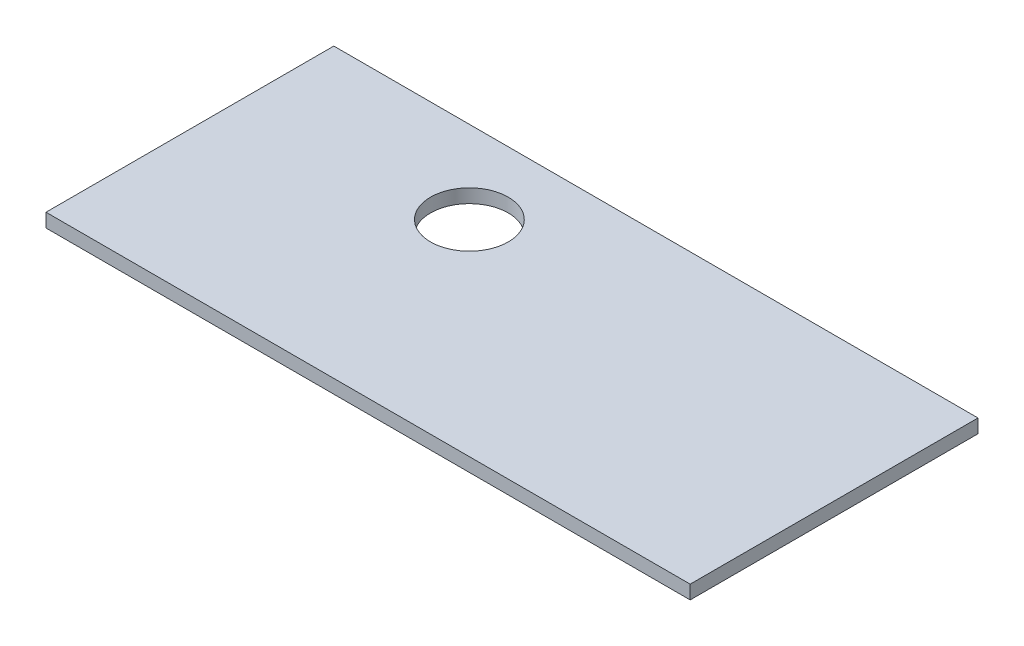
ISO-10303-21;
HEADER;
FILE_DESCRIPTION(('STEP AP214'),'2;1');
FILE_NAME('part.step','',(''),(''),'','','');
FILE_SCHEMA(('AUTOMOTIVE_DESIGN { 1 0 10303 214 1 1 1 1 }'));
ENDSEC;
DATA;
#1=APPLICATION_CONTEXT('core data for automotive mechanical design processes');
#2=APPLICATION_PROTOCOL_DEFINITION('international standard','automotive_design',2000,#1);
#3=PRODUCT_CONTEXT('',#1,'mechanical');
#4=PRODUCT('Part','Part','',(#3));
#5=PRODUCT_RELATED_PRODUCT_CATEGORY('part','',(#4));
#6=PRODUCT_DEFINITION_FORMATION('','',#4);
#7=PRODUCT_DEFINITION_CONTEXT('part definition',#1,'design');
#8=PRODUCT_DEFINITION('design','',#6,#7);
#9=PRODUCT_DEFINITION_SHAPE('','',#8);
#10=(LENGTH_UNIT() NAMED_UNIT(*) SI_UNIT(.MILLI.,.METRE.));
#11=(NAMED_UNIT(*) PLANE_ANGLE_UNIT() SI_UNIT($,.RADIAN.));
#12=(NAMED_UNIT(*) SI_UNIT($,.STERADIAN.) SOLID_ANGLE_UNIT());
#13=UNCERTAINTY_MEASURE_WITH_UNIT(LENGTH_MEASURE(1.E-05),#10,'distance_accuracy_value','');
#14=(GEOMETRIC_REPRESENTATION_CONTEXT(3) GLOBAL_UNCERTAINTY_ASSIGNED_CONTEXT((#13)) GLOBAL_UNIT_ASSIGNED_CONTEXT((#10,
#11,#12)) REPRESENTATION_CONTEXT('',''));
#15=CARTESIAN_POINT('',(0.,0.,0.));
#16=DIRECTION('',(0.,0.,1.));
#17=DIRECTION('',(1.,0.,0.));
#18=AXIS2_PLACEMENT_3D('',#15,#16,#17);
#19=CARTESIAN_POINT('',(70.5,3.,31.5));
#20=DIRECTION('',(-1.,0.,0.));
#21=DIRECTION('',(0.,0.,1.));
#22=AXIS2_PLACEMENT_3D('',#19,#20,#21);
#23=PLANE('',#22);
#24=DIRECTION('',(0.,0.,-1.));
#25=VECTOR('',#24,1.);
#26=CARTESIAN_POINT('',(70.5,0.,31.5));
#27=LINE('',#26,#25);
#28=CARTESIAN_POINT('',(70.5,0.,31.5));
#29=VERTEX_POINT('',#28);
#30=CARTESIAN_POINT('',(70.5,0.,-31.5));
#31=VERTEX_POINT('',#30);
#32=EDGE_CURVE('E97',#29,#31,#27,.T.);
#33=ORIENTED_EDGE('',*,*,#32,.T.);
#34=DIRECTION('',(0.,-1.,0.));
#35=VECTOR('',#34,1.);
#36=CARTESIAN_POINT('',(70.5,3.,-31.5));
#37=LINE('',#36,#35);
#38=CARTESIAN_POINT('',(70.5,3.,-31.5));
#39=VERTEX_POINT('',#38);
#40=EDGE_CURVE('E11',#39,#31,#37,.T.);
#41=ORIENTED_EDGE('',*,*,#40,.F.);
#42=DIRECTION('',(0.,0.,-1.));
#43=VECTOR('',#42,1.);
#44=CARTESIAN_POINT('',(70.5,3.,31.5));
#45=LINE('',#44,#43);
#46=CARTESIAN_POINT('',(70.5,3.,31.5));
#47=VERTEX_POINT('',#46);
#48=EDGE_CURVE('E85',#47,#39,#45,.T.);
#49=ORIENTED_EDGE('',*,*,#48,.F.);
#50=DIRECTION('',(0.,-1.,0.));
#51=VECTOR('',#50,1.);
#52=CARTESIAN_POINT('',(70.5,3.,31.5));
#53=LINE('',#52,#51);
#54=EDGE_CURVE('E93',#47,#29,#53,.T.);
#55=ORIENTED_EDGE('',*,*,#54,.T.);
#56=EDGE_LOOP('',(#33,#41,#49,#55));
#57=FACE_BOUND('',#56,.T.);
#58=ADVANCED_FACE('F34',(#57),#23,.F.);
#59=CARTESIAN_POINT('',(-70.5,3.,-31.5));
#60=DIRECTION('',(0.,0.,1.));
#61=DIRECTION('',(1.,0.,0.));
#62=AXIS2_PLACEMENT_3D('',#59,#60,#61);
#63=PLANE('',#62);
#64=DIRECTION('',(-1.,0.,0.));
#65=VECTOR('',#64,1.);
#66=CARTESIAN_POINT('',(-70.5,0.,-31.5));
#67=LINE('',#66,#65);
#68=CARTESIAN_POINT('',(-70.5,0.,-31.5));
#69=VERTEX_POINT('',#68);
#70=EDGE_CURVE('E89',#31,#69,#67,.T.);
#71=ORIENTED_EDGE('',*,*,#70,.T.);
#72=DIRECTION('',(0.,-1.,0.));
#73=VECTOR('',#72,1.);
#74=CARTESIAN_POINT('',(-70.5,3.,-31.5));
#75=LINE('',#74,#73);
#76=CARTESIAN_POINT('',(-70.5,3.,-31.5));
#77=VERTEX_POINT('',#76);
#78=EDGE_CURVE('E42',#77,#69,#75,.T.);
#79=ORIENTED_EDGE('',*,*,#78,.F.);
#80=DIRECTION('',(-1.,0.,0.));
#81=VECTOR('',#80,1.);
#82=CARTESIAN_POINT('',(-70.5,3.,-31.5));
#83=LINE('',#82,#81);
#84=EDGE_CURVE('E80',#39,#77,#83,.T.);
#85=ORIENTED_EDGE('',*,*,#84,.F.);
#86=ORIENTED_EDGE('',*,*,#40,.T.);
#87=EDGE_LOOP('',(#71,#79,#85,#86));
#88=FACE_BOUND('',#87,.T.);
#89=ADVANCED_FACE('F88',(#88),#63,.F.);
#90=CARTESIAN_POINT('',(-70.5,3.,31.5));
#91=DIRECTION('',(1.,0.,0.));
#92=DIRECTION('',(0.,0.,-1.));
#93=AXIS2_PLACEMENT_3D('',#90,#91,#92);
#94=PLANE('',#93);
#95=DIRECTION('',(0.,0.,1.));
#96=VECTOR('',#95,1.);
#97=CARTESIAN_POINT('',(-70.5,0.,31.5));
#98=LINE('',#97,#96);
#99=CARTESIAN_POINT('',(-70.5,0.,31.5));
#100=VERTEX_POINT('',#99);
#101=EDGE_CURVE('E67',#69,#100,#98,.T.);
#102=ORIENTED_EDGE('',*,*,#101,.T.);
#103=DIRECTION('',(0.,-1.,0.));
#104=VECTOR('',#103,1.);
#105=CARTESIAN_POINT('',(-70.5,3.,31.5));
#106=LINE('',#105,#104);
#107=CARTESIAN_POINT('',(-70.5,3.,31.5));
#108=VERTEX_POINT('',#107);
#109=EDGE_CURVE('E90',#108,#100,#106,.T.);
#110=ORIENTED_EDGE('',*,*,#109,.F.);
#111=DIRECTION('',(0.,0.,1.));
#112=VECTOR('',#111,1.);
#113=CARTESIAN_POINT('',(-70.5,3.,31.5));
#114=LINE('',#113,#112);
#115=EDGE_CURVE('E83',#77,#108,#114,.T.);
#116=ORIENTED_EDGE('',*,*,#115,.F.);
#117=ORIENTED_EDGE('',*,*,#78,.T.);
#118=EDGE_LOOP('',(#102,#110,#116,#117));
#119=FACE_BOUND('',#118,.T.);
#120=ADVANCED_FACE('F91',(#119),#94,.F.);
#121=CARTESIAN_POINT('',(-70.5,3.,31.5));
#122=DIRECTION('',(0.,0.,-1.));
#123=DIRECTION('',(-1.,0.,0.));
#124=AXIS2_PLACEMENT_3D('',#121,#122,#123);
#125=PLANE('',#124);
#126=DIRECTION('',(1.,0.,0.));
#127=VECTOR('',#126,1.);
#128=CARTESIAN_POINT('',(-70.5,0.,31.5));
#129=LINE('',#128,#127);
#130=EDGE_CURVE('E73',#100,#29,#129,.T.);
#131=ORIENTED_EDGE('',*,*,#130,.T.);
#132=ORIENTED_EDGE('',*,*,#54,.F.);
#133=DIRECTION('',(1.,0.,0.));
#134=VECTOR('',#133,1.);
#135=CARTESIAN_POINT('',(-70.5,3.,31.5));
#136=LINE('',#135,#134);
#137=EDGE_CURVE('E50',#108,#47,#136,.T.);
#138=ORIENTED_EDGE('',*,*,#137,.F.);
#139=ORIENTED_EDGE('',*,*,#109,.T.);
#140=EDGE_LOOP('',(#131,#132,#138,#139));
#141=FACE_BOUND('',#140,.T.);
#142=ADVANCED_FACE('F105',(#141),#125,.F.);
#143=CARTESIAN_POINT('',(0.,3.,0.));
#144=DIRECTION('',(0.,-1.,0.));
#145=DIRECTION('',(0.,0.,-1.));
#146=AXIS2_PLACEMENT_3D('',#143,#144,#145);
#147=PLANE('',#146);
#148=CARTESIAN_POINT('',(-22.7794225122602,3.,-13.4534041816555));
#149=DIRECTION('',(0.,1.,0.));
#150=DIRECTION('',(0.,0.,1.));
#151=AXIS2_PLACEMENT_3D('',#148,#149,#150);
#152=CIRCLE('',#151,8.5);
#153=CARTESIAN_POINT('',(-22.7794225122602,3.,-4.9534041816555));
#154=VERTEX_POINT('',#153);
#155=EDGE_CURVE('E100',#154,#154,#152,.T.);
#156=ORIENTED_EDGE('',*,*,#155,.F.);
#157=EDGE_LOOP('',(#156));
#158=FACE_BOUND('',#157,.T.);
#159=ORIENTED_EDGE('',*,*,#48,.T.);
#160=ORIENTED_EDGE('',*,*,#84,.T.);
#161=ORIENTED_EDGE('',*,*,#115,.T.);
#162=ORIENTED_EDGE('',*,*,#137,.T.);
#163=EDGE_LOOP('',(#159,#160,#161,#162));
#164=FACE_BOUND('',#163,.T.);
#165=ADVANCED_FACE('F81',(#158,#164),#147,.F.);
#166=CARTESIAN_POINT('',(0.,0.,0.));
#167=DIRECTION('',(0.,-1.,0.));
#168=DIRECTION('',(0.,0.,-1.));
#169=AXIS2_PLACEMENT_3D('',#166,#167,#168);
#170=PLANE('',#169);
#171=CARTESIAN_POINT('',(-22.7794225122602,0.,-13.4534041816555));
#172=DIRECTION('',(0.,-1.,0.));
#173=DIRECTION('',(0.,0.,-1.));
#174=AXIS2_PLACEMENT_3D('',#171,#172,#173);
#175=CIRCLE('',#174,8.5);
#176=CARTESIAN_POINT('',(-22.7794225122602,0.,-4.9534041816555));
#177=VERTEX_POINT('',#176);
#178=EDGE_CURVE('E111',#177,#177,#175,.F.);
#179=ORIENTED_EDGE('',*,*,#178,.T.);
#180=EDGE_LOOP('',(#179));
#181=FACE_BOUND('',#180,.T.);
#182=ORIENTED_EDGE('',*,*,#32,.F.);
#183=ORIENTED_EDGE('',*,*,#130,.F.);
#184=ORIENTED_EDGE('',*,*,#101,.F.);
#185=ORIENTED_EDGE('',*,*,#70,.F.);
#186=EDGE_LOOP('',(#182,#183,#184,#185));
#187=FACE_BOUND('',#186,.T.);
#188=ADVANCED_FACE('F108',(#181,#187),#170,.T.);
#189=CARTESIAN_POINT('',(-22.7794225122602,-0.00100000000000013,-13.4534041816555));
#190=DIRECTION('',(0.,1.,0.));
#191=DIRECTION('',(0.,0.,1.));
#192=AXIS2_PLACEMENT_3D('',#189,#190,#191);
#193=CYLINDRICAL_SURFACE('',#192,8.5);
#194=CARTESIAN_POINT('',(-22.7794225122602,0.,-4.9534041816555));
#195=CARTESIAN_POINT('',(-22.7794225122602,0.03125,-4.9534041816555));
#196=CARTESIAN_POINT('',(-22.7794225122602,0.0625,-4.9534041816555));
#197=CARTESIAN_POINT('',(-22.7794225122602,0.125,-4.9534041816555));
#198=CARTESIAN_POINT('',(-22.7794225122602,0.15625,-4.9534041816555));
#199=CARTESIAN_POINT('',(-22.7794225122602,0.21875,-4.9534041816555));
#200=CARTESIAN_POINT('',(-22.7794225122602,0.25,-4.9534041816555));
#201=CARTESIAN_POINT('',(-22.7794225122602,0.3125,-4.9534041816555));
#202=CARTESIAN_POINT('',(-22.7794225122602,0.34375,-4.9534041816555));
#203=CARTESIAN_POINT('',(-22.7794225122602,0.40625,-4.9534041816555));
#204=CARTESIAN_POINT('',(-22.7794225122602,0.4375,-4.9534041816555));
#205=CARTESIAN_POINT('',(-22.7794225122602,0.5,-4.9534041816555));
#206=CARTESIAN_POINT('',(-22.7794225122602,0.53125,-4.9534041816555));
#207=CARTESIAN_POINT('',(-22.7794225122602,0.59375,-4.9534041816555));
#208=CARTESIAN_POINT('',(-22.7794225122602,0.625,-4.9534041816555));
#209=CARTESIAN_POINT('',(-22.7794225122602,0.6875,-4.9534041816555));
#210=CARTESIAN_POINT('',(-22.7794225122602,0.71875,-4.9534041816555));
#211=CARTESIAN_POINT('',(-22.7794225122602,0.78125,-4.9534041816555));
#212=CARTESIAN_POINT('',(-22.7794225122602,0.8125,-4.9534041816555));
#213=CARTESIAN_POINT('',(-22.7794225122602,0.875,-4.9534041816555));
#214=CARTESIAN_POINT('',(-22.7794225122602,0.90625,-4.9534041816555));
#215=CARTESIAN_POINT('',(-22.7794225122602,0.96875,-4.9534041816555));
#216=CARTESIAN_POINT('',(-22.7794225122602,1.,-4.9534041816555));
#217=CARTESIAN_POINT('',(-22.7794225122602,1.0625,-4.9534041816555));
#218=CARTESIAN_POINT('',(-22.7794225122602,1.09375,-4.9534041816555));
#219=CARTESIAN_POINT('',(-22.7794225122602,1.15625,-4.9534041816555));
#220=CARTESIAN_POINT('',(-22.7794225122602,1.1875,-4.9534041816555));
#221=CARTESIAN_POINT('',(-22.7794225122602,1.25,-4.9534041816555));
#222=CARTESIAN_POINT('',(-22.7794225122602,1.28125,-4.9534041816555));
#223=CARTESIAN_POINT('',(-22.7794225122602,1.34375,-4.9534041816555));
#224=CARTESIAN_POINT('',(-22.7794225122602,1.375,-4.9534041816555));
#225=CARTESIAN_POINT('',(-22.7794225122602,1.4375,-4.9534041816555));
#226=CARTESIAN_POINT('',(-22.7794225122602,1.46875,-4.9534041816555));
#227=CARTESIAN_POINT('',(-22.7794225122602,1.53125,-4.9534041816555));
#228=CARTESIAN_POINT('',(-22.7794225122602,1.5625,-4.9534041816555));
#229=CARTESIAN_POINT('',(-22.7794225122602,1.625,-4.9534041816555));
#230=CARTESIAN_POINT('',(-22.7794225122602,1.65625,-4.9534041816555));
#231=CARTESIAN_POINT('',(-22.7794225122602,1.71875,-4.9534041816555));
#232=CARTESIAN_POINT('',(-22.7794225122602,1.75,-4.9534041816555));
#233=CARTESIAN_POINT('',(-22.7794225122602,1.8125,-4.9534041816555));
#234=CARTESIAN_POINT('',(-22.7794225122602,1.84375,-4.9534041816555));
#235=CARTESIAN_POINT('',(-22.7794225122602,1.90625,-4.9534041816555));
#236=CARTESIAN_POINT('',(-22.7794225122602,1.9375,-4.9534041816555));
#237=CARTESIAN_POINT('',(-22.7794225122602,2.,-4.9534041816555));
#238=CARTESIAN_POINT('',(-22.7794225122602,2.03125,-4.9534041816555));
#239=CARTESIAN_POINT('',(-22.7794225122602,2.09375,-4.9534041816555));
#240=CARTESIAN_POINT('',(-22.7794225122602,2.125,-4.9534041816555));
#241=CARTESIAN_POINT('',(-22.7794225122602,2.1875,-4.9534041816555));
#242=CARTESIAN_POINT('',(-22.7794225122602,2.21875,-4.9534041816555));
#243=CARTESIAN_POINT('',(-22.7794225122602,2.28125,-4.9534041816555));
#244=CARTESIAN_POINT('',(-22.7794225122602,2.3125,-4.9534041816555));
#245=CARTESIAN_POINT('',(-22.7794225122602,2.375,-4.9534041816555));
#246=CARTESIAN_POINT('',(-22.7794225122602,2.40625,-4.9534041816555));
#247=CARTESIAN_POINT('',(-22.7794225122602,2.46875,-4.9534041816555));
#248=CARTESIAN_POINT('',(-22.7794225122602,2.5,-4.9534041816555));
#249=CARTESIAN_POINT('',(-22.7794225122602,2.5625,-4.9534041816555));
#250=CARTESIAN_POINT('',(-22.7794225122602,2.59375,-4.9534041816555));
#251=CARTESIAN_POINT('',(-22.7794225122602,2.65625,-4.9534041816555));
#252=CARTESIAN_POINT('',(-22.7794225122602,2.6875,-4.9534041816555));
#253=CARTESIAN_POINT('',(-22.7794225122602,2.75,-4.9534041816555));
#254=CARTESIAN_POINT('',(-22.7794225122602,2.78125,-4.9534041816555));
#255=CARTESIAN_POINT('',(-22.7794225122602,2.84375,-4.9534041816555));
#256=CARTESIAN_POINT('',(-22.7794225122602,2.875,-4.9534041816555));
#257=CARTESIAN_POINT('',(-22.7794225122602,2.9375,-4.9534041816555));
#258=CARTESIAN_POINT('',(-22.7794225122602,2.96875,-4.9534041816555));
#259=CARTESIAN_POINT('',(-22.7794225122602,3.,-4.9534041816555));
#260=B_SPLINE_CURVE_WITH_KNOTS('',3,(#194,#195,#196,#197,#198,#199,#200,#201,#202,#203,#204,
#205,#206,#207,#208,#209,#210,#211,#212,#213,#214,#215,#216,#217,#218,#219,#220,#221,#222,#223,
#224,#225,#226,#227,#228,#229,#230,#231,#232,#233,#234,#235,#236,#237,#238,#239,#240,#241,#242,
#243,#244,#245,#246,#247,#248,#249,#250,#251,#252,#253,#254,#255,#256,#257,#258,#259),
.UNSPECIFIED.,.F.,.F.,(4,2,2,2,2,2,2,2,2,2,2,2,2,2,2,2,2,2,2,2,2,2,2,2,2,2,2,2,2,2,2,2,4),(0.,
0.09375,0.1875,0.28125,0.375,0.46875,0.5625,0.65625,0.75,0.84375,0.9375,1.03125,1.125,1.21875,
1.3125,1.40625,1.5,1.59375,1.6875,1.78125,1.875,1.96875,2.0625,2.15625,2.25,2.34375,2.4375,
2.53125,2.625,2.71875,2.8125,2.90625,3.),.UNSPECIFIED.);
#261=EDGE_CURVE('BSEAM117',#177,#154,#260,.T.);
#262=ORIENTED_EDGE('',*,*,#178,.F.);
#263=ORIENTED_EDGE('',*,*,#155,.T.);
#264=ORIENTED_EDGE('',*,*,#261,.T.);
#265=ORIENTED_EDGE('',*,*,#261,.F.);
#266=EDGE_LOOP('',(#262,#264,#263,#265));
#267=FACE_BOUND('',#266,.T.);
#268=ADVANCED_FACE('F117',(#267),#193,.F.);
#269=CLOSED_SHELL('',(#58,#89,#120,#142,#165,#188,#268));
#270=MANIFOLD_SOLID_BREP('B2',#269);
#271=ADVANCED_BREP_SHAPE_REPRESENTATION('',(#18,#270),#14);
#272=SHAPE_DEFINITION_REPRESENTATION(#9,#271);
ENDSEC;
END-ISO-10303-21;
